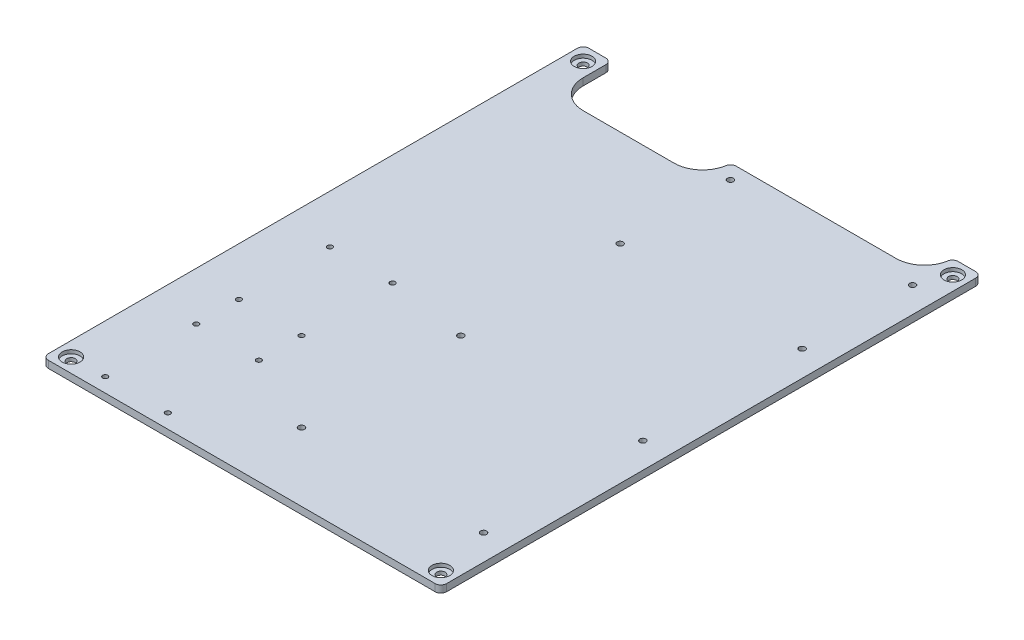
ISO-10303-21;
HEADER;
FILE_DESCRIPTION(('STEP AP214'),'2;1');
FILE_NAME('part.step','',(''),(''),'','','');
FILE_SCHEMA(('AUTOMOTIVE_DESIGN { 1 0 10303 214 1 1 1 1 }'));
ENDSEC;
DATA;
#1=APPLICATION_CONTEXT('core data for automotive mechanical design processes');
#2=APPLICATION_PROTOCOL_DEFINITION('international standard','automotive_design',2000,#1);
#3=PRODUCT_CONTEXT('',#1,'mechanical');
#4=PRODUCT('Part','Part','',(#3));
#5=PRODUCT_RELATED_PRODUCT_CATEGORY('part','',(#4));
#6=PRODUCT_DEFINITION_FORMATION('','',#4);
#7=PRODUCT_DEFINITION_CONTEXT('part definition',#1,'design');
#8=PRODUCT_DEFINITION('design','',#6,#7);
#9=PRODUCT_DEFINITION_SHAPE('','',#8);
#10=(LENGTH_UNIT() NAMED_UNIT(*) SI_UNIT(.MILLI.,.METRE.));
#11=(NAMED_UNIT(*) PLANE_ANGLE_UNIT() SI_UNIT($,.RADIAN.));
#12=(NAMED_UNIT(*) SI_UNIT($,.STERADIAN.) SOLID_ANGLE_UNIT());
#13=UNCERTAINTY_MEASURE_WITH_UNIT(LENGTH_MEASURE(1.E-05),#10,'distance_accuracy_value','');
#14=(GEOMETRIC_REPRESENTATION_CONTEXT(3) GLOBAL_UNCERTAINTY_ASSIGNED_CONTEXT((#13)) GLOBAL_UNIT_ASSIGNED_CONTEXT((#10,
#11,#12)) REPRESENTATION_CONTEXT('',''));
#15=CARTESIAN_POINT('',(0.,0.,0.));
#16=DIRECTION('',(0.,0.,1.));
#17=DIRECTION('',(1.,0.,0.));
#18=AXIS2_PLACEMENT_3D('',#15,#16,#17);
#19=CARTESIAN_POINT('',(0.,3.175,0.));
#20=DIRECTION('',(0.,-1.,0.));
#21=DIRECTION('',(0.,0.,-1.));
#22=AXIS2_PLACEMENT_3D('',#19,#20,#21);
#23=PLANE('',#22);
#24=CARTESIAN_POINT('',(21.59,3.175,-106.68));
#25=DIRECTION('',(0.,1.,0.));
#26=DIRECTION('',(0.,0.,1.));
#27=AXIS2_PLACEMENT_3D('',#24,#25,#26);
#28=CIRCLE('',#27,1.1303);
#29=CARTESIAN_POINT('',(21.59,3.175,-105.5497));
#30=VERTEX_POINT('',#29);
#31=EDGE_CURVE('E501',#30,#30,#28,.T.);
#32=ORIENTED_EDGE('',*,*,#31,.F.);
#33=EDGE_LOOP('',(#32));
#34=FACE_BOUND('',#33,.T.);
#35=CARTESIAN_POINT('',(49.53,3.175,-66.04));
#36=DIRECTION('',(0.,1.,0.));
#37=DIRECTION('',(0.,0.,1.));
#38=AXIS2_PLACEMENT_3D('',#35,#36,#37);
#39=CIRCLE('',#38,1.1303);
#40=CARTESIAN_POINT('',(49.53,3.175,-64.9097));
#41=VERTEX_POINT('',#40);
#42=EDGE_CURVE('E495',#41,#41,#39,.T.);
#43=ORIENTED_EDGE('',*,*,#42,.F.);
#44=EDGE_LOOP('',(#43));
#45=FACE_BOUND('',#44,.T.);
#46=CARTESIAN_POINT('',(21.59,3.175,-66.04));
#47=DIRECTION('',(0.,1.,0.));
#48=DIRECTION('',(0.,0.,1.));
#49=AXIS2_PLACEMENT_3D('',#46,#47,#48);
#50=CIRCLE('',#49,1.1303);
#51=CARTESIAN_POINT('',(21.59,3.175,-64.9097));
#52=VERTEX_POINT('',#51);
#53=EDGE_CURVE('E489',#52,#52,#50,.T.);
#54=ORIENTED_EDGE('',*,*,#53,.F.);
#55=EDGE_LOOP('',(#54));
#56=FACE_BOUND('',#55,.T.);
#57=CARTESIAN_POINT('',(49.53,3.175,-106.68));
#58=DIRECTION('',(0.,1.,0.));
#59=DIRECTION('',(0.,0.,1.));
#60=AXIS2_PLACEMENT_3D('',#57,#58,#59);
#61=CIRCLE('',#60,1.1303);
#62=CARTESIAN_POINT('',(49.53,3.175,-105.5497));
#63=VERTEX_POINT('',#62);
#64=EDGE_CURVE('E483',#63,#63,#61,.T.);
#65=ORIENTED_EDGE('',*,*,#64,.F.);
#66=EDGE_LOOP('',(#65));
#67=FACE_BOUND('',#66,.T.);
#68=CARTESIAN_POINT('',(21.59,3.175,-46.99));
#69=DIRECTION('',(0.,1.,0.));
#70=DIRECTION('',(0.,0.,1.));
#71=AXIS2_PLACEMENT_3D('',#68,#69,#70);
#72=CIRCLE('',#71,1.1303);
#73=CARTESIAN_POINT('',(21.59,3.175,-45.8597));
#74=VERTEX_POINT('',#73);
#75=EDGE_CURVE('E477',#74,#74,#72,.T.);
#76=ORIENTED_EDGE('',*,*,#75,.F.);
#77=EDGE_LOOP('',(#76));
#78=FACE_BOUND('',#77,.T.);
#79=CARTESIAN_POINT('',(21.59,3.175,-6.34999999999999));
#80=DIRECTION('',(0.,1.,0.));
#81=DIRECTION('',(0.,0.,1.));
#82=AXIS2_PLACEMENT_3D('',#79,#80,#81);
#83=CIRCLE('',#82,1.1303);
#84=CARTESIAN_POINT('',(21.59,3.175,-5.21969999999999));
#85=VERTEX_POINT('',#84);
#86=EDGE_CURVE('E465',#85,#85,#83,.T.);
#87=ORIENTED_EDGE('',*,*,#86,.F.);
#88=EDGE_LOOP('',(#87));
#89=FACE_BOUND('',#88,.T.);
#90=CARTESIAN_POINT('',(49.53,3.175,-46.99));
#91=DIRECTION('',(0.,1.,0.));
#92=DIRECTION('',(0.,0.,1.));
#93=AXIS2_PLACEMENT_3D('',#90,#91,#92);
#94=CIRCLE('',#93,1.1303);
#95=CARTESIAN_POINT('',(49.53,3.175,-45.8597));
#96=VERTEX_POINT('',#95);
#97=EDGE_CURVE('E459',#96,#96,#94,.T.);
#98=ORIENTED_EDGE('',*,*,#97,.F.);
#99=EDGE_LOOP('',(#98));
#100=FACE_BOUND('',#99,.T.);
#101=CARTESIAN_POINT('',(85.09,3.175,-221.996));
#102=DIRECTION('',(0.,1.,0.));
#103=DIRECTION('',(0.,0.,1.));
#104=AXIS2_PLACEMENT_3D('',#101,#102,#103);
#105=CIRCLE('',#104,1.35254999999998);
#106=CARTESIAN_POINT('',(85.09,3.175,-220.64345));
#107=VERTEX_POINT('',#106);
#108=EDGE_CURVE('E453',#107,#107,#105,.T.);
#109=ORIENTED_EDGE('',*,*,#108,.F.);
#110=EDGE_LOOP('',(#109));
#111=FACE_BOUND('',#110,.T.);
#112=CARTESIAN_POINT('',(166.37,3.175,-172.72));
#113=DIRECTION('',(0.,1.,0.));
#114=DIRECTION('',(0.,0.,1.));
#115=AXIS2_PLACEMENT_3D('',#112,#113,#114);
#116=CIRCLE('',#115,1.35254999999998);
#117=CARTESIAN_POINT('',(166.37,3.175,-171.36745));
#118=VERTEX_POINT('',#117);
#119=EDGE_CURVE('E447',#118,#118,#116,.T.);
#120=ORIENTED_EDGE('',*,*,#119,.F.);
#121=EDGE_LOOP('',(#120));
#122=FACE_BOUND('',#121,.T.);
#123=CARTESIAN_POINT('',(85.09,3.175,-172.72));
#124=DIRECTION('',(0.,1.,0.));
#125=DIRECTION('',(0.,0.,1.));
#126=AXIS2_PLACEMENT_3D('',#123,#124,#125);
#127=CIRCLE('',#126,1.35254999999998);
#128=CARTESIAN_POINT('',(85.09,3.175,-171.36745));
#129=VERTEX_POINT('',#128);
#130=EDGE_CURVE('E441',#129,#129,#127,.T.);
#131=ORIENTED_EDGE('',*,*,#130,.F.);
#132=EDGE_LOOP('',(#131));
#133=FACE_BOUND('',#132,.T.);
#134=CARTESIAN_POINT('',(166.37,3.175,-221.996));
#135=DIRECTION('',(0.,1.,0.));
#136=DIRECTION('',(0.,0.,1.));
#137=AXIS2_PLACEMENT_3D('',#134,#135,#136);
#138=CIRCLE('',#137,1.35254999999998);
#139=CARTESIAN_POINT('',(166.37,3.175,-220.64345));
#140=VERTEX_POINT('',#139);
#141=EDGE_CURVE('E435',#140,#140,#138,.T.);
#142=ORIENTED_EDGE('',*,*,#141,.F.);
#143=EDGE_LOOP('',(#142));
#144=FACE_BOUND('',#143,.T.);
#145=CARTESIAN_POINT('',(166.37,3.175,-101.6));
#146=DIRECTION('',(0.,1.,0.));
#147=DIRECTION('',(0.,0.,1.));
#148=AXIS2_PLACEMENT_3D('',#145,#146,#147);
#149=CIRCLE('',#148,1.35254999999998);
#150=CARTESIAN_POINT('',(166.37,3.175,-100.24745));
#151=VERTEX_POINT('',#150);
#152=EDGE_CURVE('E429',#151,#151,#149,.T.);
#153=ORIENTED_EDGE('',*,*,#152,.F.);
#154=EDGE_LOOP('',(#153));
#155=FACE_BOUND('',#154,.T.);
#156=CARTESIAN_POINT('',(85.09,3.175,-101.6));
#157=DIRECTION('',(0.,1.,0.));
#158=DIRECTION('',(0.,0.,1.));
#159=AXIS2_PLACEMENT_3D('',#156,#157,#158);
#160=CIRCLE('',#159,1.35254999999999);
#161=CARTESIAN_POINT('',(85.09,3.175,-100.24745));
#162=VERTEX_POINT('',#161);
#163=EDGE_CURVE('E423',#162,#162,#160,.T.);
#164=ORIENTED_EDGE('',*,*,#163,.F.);
#165=EDGE_LOOP('',(#164));
#166=FACE_BOUND('',#165,.T.);
#167=CARTESIAN_POINT('',(85.09,3.175,-30.48));
#168=DIRECTION('',(0.,1.,0.));
#169=DIRECTION('',(0.,0.,1.));
#170=AXIS2_PLACEMENT_3D('',#167,#168,#169);
#171=CIRCLE('',#170,1.35254999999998);
#172=CARTESIAN_POINT('',(85.09,3.175,-29.12745));
#173=VERTEX_POINT('',#172);
#174=EDGE_CURVE('E417',#173,#173,#171,.T.);
#175=ORIENTED_EDGE('',*,*,#174,.F.);
#176=EDGE_LOOP('',(#175));
#177=FACE_BOUND('',#176,.T.);
#178=CARTESIAN_POINT('',(166.37,3.175,-30.48));
#179=DIRECTION('',(0.,1.,0.));
#180=DIRECTION('',(0.,0.,1.));
#181=AXIS2_PLACEMENT_3D('',#178,#179,#180);
#182=CIRCLE('',#181,1.35254999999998);
#183=CARTESIAN_POINT('',(166.37,3.175,-29.12745));
#184=VERTEX_POINT('',#183);
#185=EDGE_CURVE('E411',#184,#184,#182,.T.);
#186=ORIENTED_EDGE('',*,*,#185,.F.);
#187=EDGE_LOOP('',(#186));
#188=FACE_BOUND('',#187,.T.);
#189=CARTESIAN_POINT('',(6.35000000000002,3.175,-6.34999999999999));
#190=DIRECTION('',(0.,1.,0.));
#191=DIRECTION('',(0.,0.,1.));
#192=AXIS2_PLACEMENT_3D('',#189,#190,#191);
#193=CIRCLE('',#192,3.96875);
#194=CARTESIAN_POINT('',(6.35000000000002,3.175,-2.38125));
#195=VERTEX_POINT('',#194);
#196=EDGE_CURVE('E405',#195,#195,#193,.T.);
#197=ORIENTED_EDGE('',*,*,#196,.F.);
#198=EDGE_LOOP('',(#197));
#199=FACE_BOUND('',#198,.T.);
#200=CARTESIAN_POINT('',(171.45,3.175,-6.34999999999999));
#201=DIRECTION('',(0.,1.,0.));
#202=DIRECTION('',(0.,0.,1.));
#203=AXIS2_PLACEMENT_3D('',#200,#201,#202);
#204=CIRCLE('',#203,3.96874999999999);
#205=CARTESIAN_POINT('',(171.45,3.175,-2.38125));
#206=VERTEX_POINT('',#205);
#207=EDGE_CURVE('E393',#206,#206,#204,.T.);
#208=ORIENTED_EDGE('',*,*,#207,.F.);
#209=EDGE_LOOP('',(#208));
#210=FACE_BOUND('',#209,.T.);
#211=CARTESIAN_POINT('',(171.45,3.175,-234.95));
#212=DIRECTION('',(0.,1.,0.));
#213=DIRECTION('',(0.,0.,1.));
#214=AXIS2_PLACEMENT_3D('',#211,#212,#213);
#215=CIRCLE('',#214,3.96874999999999);
#216=CARTESIAN_POINT('',(171.45,3.175,-230.98125));
#217=VERTEX_POINT('',#216);
#218=EDGE_CURVE('E381',#217,#217,#215,.T.);
#219=ORIENTED_EDGE('',*,*,#218,.F.);
#220=EDGE_LOOP('',(#219));
#221=FACE_BOUND('',#220,.T.);
#222=CARTESIAN_POINT('',(6.35000000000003,3.175,-234.95));
#223=DIRECTION('',(0.,1.,0.));
#224=DIRECTION('',(0.,0.,1.));
#225=AXIS2_PLACEMENT_3D('',#222,#223,#224);
#226=CIRCLE('',#225,3.96875);
#227=CARTESIAN_POINT('',(6.35000000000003,3.175,-230.98125));
#228=VERTEX_POINT('',#227);
#229=EDGE_CURVE('E369',#228,#228,#226,.T.);
#230=ORIENTED_EDGE('',*,*,#229,.F.);
#231=EDGE_LOOP('',(#230));
#232=FACE_BOUND('',#231,.T.);
#233=DIRECTION('',(-1.,0.,0.));
#234=VECTOR('',#233,1.);
#235=CARTESIAN_POINT('',(0.,3.175,-241.3));
#236=LINE('',#235,#234);
#237=CARTESIAN_POINT('',(175.26,3.175,-241.3));
#238=VERTEX_POINT('',#237);
#239=CARTESIAN_POINT('',(167.426842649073,3.175,-241.3));
#240=VERTEX_POINT('',#239);
#241=EDGE_CURVE('E208',#238,#240,#236,.T.);
#242=ORIENTED_EDGE('',*,*,#241,.T.);
#243=CARTESIAN_POINT('',(167.426842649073,3.175,-238.76));
#244=DIRECTION('',(0.,-1.,0.));
#245=DIRECTION('',(0.,0.,-1.));
#246=AXIS2_PLACEMENT_3D('',#243,#244,#245);
#247=CIRCLE('',#246,2.54);
#248=CARTESIAN_POINT('',(164.922368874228,3.175,-239.183333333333));
#249=VERTEX_POINT('',#248);
#250=EDGE_CURVE('E281',#240,#249,#247,.F.);
#251=ORIENTED_EDGE('',*,*,#250,.T.);
#252=CARTESIAN_POINT('',(152.4,3.175,-241.3));
#253=DIRECTION('',(0.,-1.,0.));
#254=DIRECTION('',(0.,0.,-1.));
#255=AXIS2_PLACEMENT_3D('',#252,#253,#254);
#256=CIRCLE('',#255,12.7);
#257=CARTESIAN_POINT('',(152.4,3.175,-228.6));
#258=VERTEX_POINT('',#257);
#259=EDGE_CURVE('E259',#249,#258,#256,.T.);
#260=ORIENTED_EDGE('',*,*,#259,.T.);
#261=DIRECTION('',(1.,0.,0.));
#262=VECTOR('',#261,1.);
#263=CARTESIAN_POINT('',(165.1,3.175,-228.6));
#264=LINE('',#263,#262);
#265=CARTESIAN_POINT('',(81.066842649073,3.175,-228.6));
#266=VERTEX_POINT('',#265);
#267=EDGE_CURVE('E310',#266,#258,#264,.T.);
#268=ORIENTED_EDGE('',*,*,#267,.F.);
#269=CARTESIAN_POINT('',(81.066842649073,3.175,-226.06));
#270=DIRECTION('',(0.,-1.,0.));
#271=DIRECTION('',(0.,0.,-1.));
#272=AXIS2_PLACEMENT_3D('',#269,#270,#271);
#273=CIRCLE('',#272,2.54);
#274=CARTESIAN_POINT('',(78.5623688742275,3.175,-226.483333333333));
#275=VERTEX_POINT('',#274);
#276=EDGE_CURVE('E58',#266,#275,#273,.F.);
#277=ORIENTED_EDGE('',*,*,#276,.T.);
#278=CARTESIAN_POINT('',(66.04,3.175,-228.6));
#279=DIRECTION('',(0.,-1.,0.));
#280=DIRECTION('',(0.,0.,-1.));
#281=AXIS2_PLACEMENT_3D('',#278,#279,#280);
#282=CIRCLE('',#281,12.7);
#283=CARTESIAN_POINT('',(66.04,3.175,-215.9));
#284=VERTEX_POINT('',#283);
#285=EDGE_CURVE('E265',#275,#284,#282,.T.);
#286=ORIENTED_EDGE('',*,*,#285,.T.);
#287=DIRECTION('',(1.,0.,0.));
#288=VECTOR('',#287,1.);
#289=CARTESIAN_POINT('',(12.7,3.175,-215.9));
#290=LINE('',#289,#288);
#291=CARTESIAN_POINT('',(25.4,3.175,-215.9));
#292=VERTEX_POINT('',#291);
#293=EDGE_CURVE('E303',#292,#284,#290,.T.);
#294=ORIENTED_EDGE('',*,*,#293,.F.);
#295=CARTESIAN_POINT('',(25.4,3.175,-228.6));
#296=DIRECTION('',(0.,-1.,0.));
#297=DIRECTION('',(0.,0.,-1.));
#298=AXIS2_PLACEMENT_3D('',#295,#296,#297);
#299=CIRCLE('',#298,12.7);
#300=CARTESIAN_POINT('',(12.7,3.175,-228.6));
#301=VERTEX_POINT('',#300);
#302=EDGE_CURVE('E269',#292,#301,#299,.T.);
#303=ORIENTED_EDGE('',*,*,#302,.T.);
#304=DIRECTION('',(0.,0.,1.));
#305=VECTOR('',#304,1.);
#306=CARTESIAN_POINT('',(12.7,3.175,-241.3));
#307=LINE('',#306,#305);
#308=CARTESIAN_POINT('',(12.7,3.175,-238.76));
#309=VERTEX_POINT('',#308);
#310=EDGE_CURVE('E302',#309,#301,#307,.T.);
#311=ORIENTED_EDGE('',*,*,#310,.F.);
#312=CARTESIAN_POINT('',(10.16,3.175,-238.76));
#313=DIRECTION('',(0.,-1.,0.));
#314=DIRECTION('',(0.,0.,-1.));
#315=AXIS2_PLACEMENT_3D('',#312,#313,#314);
#316=CIRCLE('',#315,2.54);
#317=CARTESIAN_POINT('',(10.16,3.175,-241.3));
#318=VERTEX_POINT('',#317);
#319=EDGE_CURVE('E226',#309,#318,#316,.F.);
#320=ORIENTED_EDGE('',*,*,#319,.T.);
#321=CARTESIAN_POINT('',(2.54,3.175,-241.3));
#322=VERTEX_POINT('',#321);
#323=EDGE_CURVE('E186',#318,#322,#236,.T.);
#324=ORIENTED_EDGE('',*,*,#323,.T.);
#325=CARTESIAN_POINT('',(2.54,3.175,-238.76));
#326=DIRECTION('',(0.,-1.,0.));
#327=DIRECTION('',(0.,0.,-1.));
#328=AXIS2_PLACEMENT_3D('',#325,#326,#327);
#329=CIRCLE('',#328,2.54);
#330=CARTESIAN_POINT('',(0.,3.175,-238.76));
#331=VERTEX_POINT('',#330);
#332=EDGE_CURVE('E218',#322,#331,#329,.F.);
#333=ORIENTED_EDGE('',*,*,#332,.T.);
#334=DIRECTION('',(0.,0.,1.));
#335=VECTOR('',#334,1.);
#336=CARTESIAN_POINT('',(0.,3.175,0.));
#337=LINE('',#336,#335);
#338=CARTESIAN_POINT('',(0.,3.175,-2.54));
#339=VERTEX_POINT('',#338);
#340=EDGE_CURVE('E198',#331,#339,#337,.T.);
#341=ORIENTED_EDGE('',*,*,#340,.T.);
#342=CARTESIAN_POINT('',(2.54,3.175,-2.54));
#343=DIRECTION('',(0.,-1.,0.));
#344=DIRECTION('',(0.,0.,-1.));
#345=AXIS2_PLACEMENT_3D('',#342,#343,#344);
#346=CIRCLE('',#345,2.54);
#347=CARTESIAN_POINT('',(2.54,3.175,0.));
#348=VERTEX_POINT('',#347);
#349=EDGE_CURVE('E222',#339,#348,#346,.F.);
#350=ORIENTED_EDGE('',*,*,#349,.T.);
#351=DIRECTION('',(1.,0.,0.));
#352=VECTOR('',#351,1.);
#353=CARTESIAN_POINT('',(0.,3.175,0.));
#354=LINE('',#353,#352);
#355=CARTESIAN_POINT('',(175.26,3.175,0.));
#356=VERTEX_POINT('',#355);
#357=EDGE_CURVE('E316',#348,#356,#354,.T.);
#358=ORIENTED_EDGE('',*,*,#357,.T.);
#359=CARTESIAN_POINT('',(175.26,3.175,-2.54));
#360=DIRECTION('',(0.,-1.,0.));
#361=DIRECTION('',(0.,0.,-1.));
#362=AXIS2_PLACEMENT_3D('',#359,#360,#361);
#363=CIRCLE('',#362,2.54);
#364=CARTESIAN_POINT('',(177.8,3.175,-2.54));
#365=VERTEX_POINT('',#364);
#366=EDGE_CURVE('E224',#356,#365,#363,.F.);
#367=ORIENTED_EDGE('',*,*,#366,.T.);
#368=DIRECTION('',(0.,0.,-1.));
#369=VECTOR('',#368,1.);
#370=CARTESIAN_POINT('',(177.8,3.175,0.));
#371=LINE('',#370,#369);
#372=CARTESIAN_POINT('',(177.8,3.175,-238.76));
#373=VERTEX_POINT('',#372);
#374=EDGE_CURVE('E319',#365,#373,#371,.T.);
#375=ORIENTED_EDGE('',*,*,#374,.T.);
#376=CARTESIAN_POINT('',(175.26,3.175,-238.76));
#377=DIRECTION('',(0.,-1.,0.));
#378=DIRECTION('',(0.,0.,-1.));
#379=AXIS2_PLACEMENT_3D('',#376,#377,#378);
#380=CIRCLE('',#379,2.54);
#381=EDGE_CURVE('E220',#373,#238,#380,.F.);
#382=ORIENTED_EDGE('',*,*,#381,.T.);
#383=EDGE_LOOP('',(#242,#251,#260,#268,#277,#286,#294,#303,#311,#320,#324,#333,#341,#350,#358,
#367,#375,#382));
#384=FACE_BOUND('',#383,.T.);
#385=CARTESIAN_POINT('',(49.53,3.175,-6.34999999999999));
#386=DIRECTION('',(0.,1.,0.));
#387=DIRECTION('',(0.,0.,1.));
#388=AXIS2_PLACEMENT_3D('',#385,#386,#387);
#389=CIRCLE('',#388,1.1303);
#390=CARTESIAN_POINT('',(49.53,3.175,-5.21969999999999));
#391=VERTEX_POINT('',#390);
#392=EDGE_CURVE('E471',#391,#391,#389,.T.);
#393=ORIENTED_EDGE('',*,*,#392,.F.);
#394=EDGE_LOOP('',(#393));
#395=FACE_BOUND('',#394,.T.);
#396=ADVANCED_FACE('F43',(#34,#45,#56,#67,#78,#89,#100,#111,#122,#133,#144,#155,#166,#177,#188,
#199,#210,#221,#232,#384,#395),#23,.F.);
#397=CARTESIAN_POINT('',(0.,0.,0.));
#398=DIRECTION('',(0.,-1.,0.));
#399=DIRECTION('',(0.,0.,-1.));
#400=AXIS2_PLACEMENT_3D('',#397,#398,#399);
#401=PLANE('',#400);
#402=CARTESIAN_POINT('',(21.59,0.,-106.68));
#403=DIRECTION('',(0.,1.,0.));
#404=DIRECTION('',(0.,0.,1.));
#405=AXIS2_PLACEMENT_3D('',#402,#403,#404);
#406=CIRCLE('',#405,1.1303);
#407=CARTESIAN_POINT('',(21.59,0.,-105.5497));
#408=VERTEX_POINT('',#407);
#409=EDGE_CURVE('E498',#408,#408,#406,.T.);
#410=ORIENTED_EDGE('',*,*,#409,.T.);
#411=EDGE_LOOP('',(#410));
#412=FACE_BOUND('',#411,.T.);
#413=CARTESIAN_POINT('',(49.53,0.,-66.04));
#414=DIRECTION('',(0.,1.,0.));
#415=DIRECTION('',(0.,0.,1.));
#416=AXIS2_PLACEMENT_3D('',#413,#414,#415);
#417=CIRCLE('',#416,1.1303);
#418=CARTESIAN_POINT('',(49.53,0.,-64.9097));
#419=VERTEX_POINT('',#418);
#420=EDGE_CURVE('E492',#419,#419,#417,.T.);
#421=ORIENTED_EDGE('',*,*,#420,.T.);
#422=EDGE_LOOP('',(#421));
#423=FACE_BOUND('',#422,.T.);
#424=CARTESIAN_POINT('',(21.59,0.,-66.04));
#425=DIRECTION('',(0.,1.,0.));
#426=DIRECTION('',(0.,0.,1.));
#427=AXIS2_PLACEMENT_3D('',#424,#425,#426);
#428=CIRCLE('',#427,1.1303);
#429=CARTESIAN_POINT('',(21.59,0.,-64.9097));
#430=VERTEX_POINT('',#429);
#431=EDGE_CURVE('E486',#430,#430,#428,.T.);
#432=ORIENTED_EDGE('',*,*,#431,.T.);
#433=EDGE_LOOP('',(#432));
#434=FACE_BOUND('',#433,.T.);
#435=CARTESIAN_POINT('',(49.53,0.,-106.68));
#436=DIRECTION('',(0.,1.,0.));
#437=DIRECTION('',(0.,0.,1.));
#438=AXIS2_PLACEMENT_3D('',#435,#436,#437);
#439=CIRCLE('',#438,1.1303);
#440=CARTESIAN_POINT('',(49.53,0.,-105.5497));
#441=VERTEX_POINT('',#440);
#442=EDGE_CURVE('E480',#441,#441,#439,.T.);
#443=ORIENTED_EDGE('',*,*,#442,.T.);
#444=EDGE_LOOP('',(#443));
#445=FACE_BOUND('',#444,.T.);
#446=CARTESIAN_POINT('',(21.59,0.,-46.99));
#447=DIRECTION('',(0.,1.,0.));
#448=DIRECTION('',(0.,0.,1.));
#449=AXIS2_PLACEMENT_3D('',#446,#447,#448);
#450=CIRCLE('',#449,1.1303);
#451=CARTESIAN_POINT('',(21.59,0.,-45.8597));
#452=VERTEX_POINT('',#451);
#453=EDGE_CURVE('E474',#452,#452,#450,.T.);
#454=ORIENTED_EDGE('',*,*,#453,.T.);
#455=EDGE_LOOP('',(#454));
#456=FACE_BOUND('',#455,.T.);
#457=CARTESIAN_POINT('',(49.53,0.,-6.34999999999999));
#458=DIRECTION('',(0.,1.,0.));
#459=DIRECTION('',(0.,0.,1.));
#460=AXIS2_PLACEMENT_3D('',#457,#458,#459);
#461=CIRCLE('',#460,1.1303);
#462=CARTESIAN_POINT('',(49.53,0.,-5.21969999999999));
#463=VERTEX_POINT('',#462);
#464=EDGE_CURVE('E468',#463,#463,#461,.T.);
#465=ORIENTED_EDGE('',*,*,#464,.T.);
#466=EDGE_LOOP('',(#465));
#467=FACE_BOUND('',#466,.T.);
#468=CARTESIAN_POINT('',(21.59,0.,-6.34999999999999));
#469=DIRECTION('',(0.,1.,0.));
#470=DIRECTION('',(0.,0.,1.));
#471=AXIS2_PLACEMENT_3D('',#468,#469,#470);
#472=CIRCLE('',#471,1.1303);
#473=CARTESIAN_POINT('',(21.59,0.,-5.21969999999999));
#474=VERTEX_POINT('',#473);
#475=EDGE_CURVE('E462',#474,#474,#472,.T.);
#476=ORIENTED_EDGE('',*,*,#475,.T.);
#477=EDGE_LOOP('',(#476));
#478=FACE_BOUND('',#477,.T.);
#479=CARTESIAN_POINT('',(49.53,0.,-46.99));
#480=DIRECTION('',(0.,1.,0.));
#481=DIRECTION('',(0.,0.,1.));
#482=AXIS2_PLACEMENT_3D('',#479,#480,#481);
#483=CIRCLE('',#482,1.1303);
#484=CARTESIAN_POINT('',(49.53,0.,-45.8597));
#485=VERTEX_POINT('',#484);
#486=EDGE_CURVE('E456',#485,#485,#483,.T.);
#487=ORIENTED_EDGE('',*,*,#486,.T.);
#488=EDGE_LOOP('',(#487));
#489=FACE_BOUND('',#488,.T.);
#490=CARTESIAN_POINT('',(85.09,0.,-221.996));
#491=DIRECTION('',(0.,1.,0.));
#492=DIRECTION('',(0.,0.,1.));
#493=AXIS2_PLACEMENT_3D('',#490,#491,#492);
#494=CIRCLE('',#493,1.35254999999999);
#495=CARTESIAN_POINT('',(85.09,0.,-220.64345));
#496=VERTEX_POINT('',#495);
#497=EDGE_CURVE('E450',#496,#496,#494,.T.);
#498=ORIENTED_EDGE('',*,*,#497,.T.);
#499=EDGE_LOOP('',(#498));
#500=FACE_BOUND('',#499,.T.);
#501=CARTESIAN_POINT('',(166.37,0.,-172.72));
#502=DIRECTION('',(0.,1.,0.));
#503=DIRECTION('',(0.,0.,1.));
#504=AXIS2_PLACEMENT_3D('',#501,#502,#503);
#505=CIRCLE('',#504,1.35255000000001);
#506=CARTESIAN_POINT('',(166.37,0.,-171.36745));
#507=VERTEX_POINT('',#506);
#508=EDGE_CURVE('E444',#507,#507,#505,.T.);
#509=ORIENTED_EDGE('',*,*,#508,.T.);
#510=EDGE_LOOP('',(#509));
#511=FACE_BOUND('',#510,.T.);
#512=CARTESIAN_POINT('',(85.09,0.,-172.72));
#513=DIRECTION('',(0.,1.,0.));
#514=DIRECTION('',(0.,0.,1.));
#515=AXIS2_PLACEMENT_3D('',#512,#513,#514);
#516=CIRCLE('',#515,1.35254999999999);
#517=CARTESIAN_POINT('',(85.09,0.,-171.36745));
#518=VERTEX_POINT('',#517);
#519=EDGE_CURVE('E438',#518,#518,#516,.T.);
#520=ORIENTED_EDGE('',*,*,#519,.T.);
#521=EDGE_LOOP('',(#520));
#522=FACE_BOUND('',#521,.T.);
#523=CARTESIAN_POINT('',(166.37,0.,-221.996));
#524=DIRECTION('',(0.,1.,0.));
#525=DIRECTION('',(0.,0.,1.));
#526=AXIS2_PLACEMENT_3D('',#523,#524,#525);
#527=CIRCLE('',#526,1.35255000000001);
#528=CARTESIAN_POINT('',(166.37,0.,-220.64345));
#529=VERTEX_POINT('',#528);
#530=EDGE_CURVE('E432',#529,#529,#527,.T.);
#531=ORIENTED_EDGE('',*,*,#530,.T.);
#532=EDGE_LOOP('',(#531));
#533=FACE_BOUND('',#532,.T.);
#534=CARTESIAN_POINT('',(166.37,0.,-101.6));
#535=DIRECTION('',(0.,1.,0.));
#536=DIRECTION('',(0.,0.,1.));
#537=AXIS2_PLACEMENT_3D('',#534,#535,#536);
#538=CIRCLE('',#537,1.35255000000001);
#539=CARTESIAN_POINT('',(166.37,0.,-100.24745));
#540=VERTEX_POINT('',#539);
#541=EDGE_CURVE('E426',#540,#540,#538,.T.);
#542=ORIENTED_EDGE('',*,*,#541,.T.);
#543=EDGE_LOOP('',(#542));
#544=FACE_BOUND('',#543,.T.);
#545=CARTESIAN_POINT('',(85.09,0.,-101.6));
#546=DIRECTION('',(0.,1.,0.));
#547=DIRECTION('',(0.,0.,1.));
#548=AXIS2_PLACEMENT_3D('',#545,#546,#547);
#549=CIRCLE('',#548,1.35254999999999);
#550=CARTESIAN_POINT('',(85.09,0.,-100.24745));
#551=VERTEX_POINT('',#550);
#552=EDGE_CURVE('E420',#551,#551,#549,.T.);
#553=ORIENTED_EDGE('',*,*,#552,.T.);
#554=EDGE_LOOP('',(#553));
#555=FACE_BOUND('',#554,.T.);
#556=CARTESIAN_POINT('',(166.37,0.,-30.48));
#557=DIRECTION('',(0.,1.,0.));
#558=DIRECTION('',(0.,0.,1.));
#559=AXIS2_PLACEMENT_3D('',#556,#557,#558);
#560=CIRCLE('',#559,1.35255000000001);
#561=CARTESIAN_POINT('',(166.37,0.,-29.12745));
#562=VERTEX_POINT('',#561);
#563=EDGE_CURVE('E408',#562,#562,#560,.T.);
#564=ORIENTED_EDGE('',*,*,#563,.T.);
#565=EDGE_LOOP('',(#564));
#566=FACE_BOUND('',#565,.T.);
#567=CARTESIAN_POINT('',(6.35000000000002,0.,-6.34999999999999));
#568=DIRECTION('',(0.,1.,0.));
#569=DIRECTION('',(0.,0.,1.));
#570=AXIS2_PLACEMENT_3D('',#567,#568,#569);
#571=CIRCLE('',#570,1.89865000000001);
#572=CARTESIAN_POINT('',(6.35000000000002,0.,-4.45134999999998));
#573=VERTEX_POINT('',#572);
#574=EDGE_CURVE('E396',#573,#573,#571,.T.);
#575=ORIENTED_EDGE('',*,*,#574,.T.);
#576=EDGE_LOOP('',(#575));
#577=FACE_BOUND('',#576,.T.);
#578=CARTESIAN_POINT('',(171.45,0.,-6.34999999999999));
#579=DIRECTION('',(0.,1.,0.));
#580=DIRECTION('',(0.,0.,1.));
#581=AXIS2_PLACEMENT_3D('',#578,#579,#580);
#582=CIRCLE('',#581,1.89865);
#583=CARTESIAN_POINT('',(171.45,0.,-4.45134999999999));
#584=VERTEX_POINT('',#583);
#585=EDGE_CURVE('E384',#584,#584,#582,.T.);
#586=ORIENTED_EDGE('',*,*,#585,.T.);
#587=EDGE_LOOP('',(#586));
#588=FACE_BOUND('',#587,.T.);
#589=CARTESIAN_POINT('',(171.45,0.,-234.95));
#590=DIRECTION('',(0.,1.,0.));
#591=DIRECTION('',(0.,0.,1.));
#592=AXIS2_PLACEMENT_3D('',#589,#590,#591);
#593=CIRCLE('',#592,1.89865);
#594=CARTESIAN_POINT('',(171.45,0.,-233.05135));
#595=VERTEX_POINT('',#594);
#596=EDGE_CURVE('E372',#595,#595,#593,.T.);
#597=ORIENTED_EDGE('',*,*,#596,.T.);
#598=EDGE_LOOP('',(#597));
#599=FACE_BOUND('',#598,.T.);
#600=CARTESIAN_POINT('',(6.35000000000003,0.,-234.95));
#601=DIRECTION('',(0.,1.,0.));
#602=DIRECTION('',(0.,0.,1.));
#603=AXIS2_PLACEMENT_3D('',#600,#601,#602);
#604=CIRCLE('',#603,1.89865000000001);
#605=CARTESIAN_POINT('',(6.35000000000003,0.,-233.05135));
#606=VERTEX_POINT('',#605);
#607=EDGE_CURVE('E359',#606,#606,#604,.T.);
#608=ORIENTED_EDGE('',*,*,#607,.T.);
#609=EDGE_LOOP('',(#608));
#610=FACE_BOUND('',#609,.T.);
#611=CARTESIAN_POINT('',(152.4,0.,-241.3));
#612=DIRECTION('',(0.,-1.,0.));
#613=DIRECTION('',(0.,0.,-1.));
#614=AXIS2_PLACEMENT_3D('',#611,#612,#613);
#615=CIRCLE('',#614,12.7);
#616=CARTESIAN_POINT('',(152.4,0.,-228.6));
#617=VERTEX_POINT('',#616);
#618=CARTESIAN_POINT('',(164.922368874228,0.,-239.183333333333));
#619=VERTEX_POINT('',#618);
#620=EDGE_CURVE('E257',#617,#619,#615,.F.);
#621=ORIENTED_EDGE('',*,*,#620,.T.);
#622=CARTESIAN_POINT('',(167.426842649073,0.,-238.76));
#623=DIRECTION('',(0.,-1.,0.));
#624=DIRECTION('',(0.,0.,-1.));
#625=AXIS2_PLACEMENT_3D('',#622,#623,#624);
#626=CIRCLE('',#625,2.54);
#627=CARTESIAN_POINT('',(167.426842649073,0.,-241.3));
#628=VERTEX_POINT('',#627);
#629=EDGE_CURVE('E276',#619,#628,#626,.T.);
#630=ORIENTED_EDGE('',*,*,#629,.T.);
#631=DIRECTION('',(-1.,0.,0.));
#632=VECTOR('',#631,1.);
#633=CARTESIAN_POINT('',(0.,0.,-241.3));
#634=LINE('',#633,#632);
#635=CARTESIAN_POINT('',(175.26,0.,-241.3));
#636=VERTEX_POINT('',#635);
#637=EDGE_CURVE('E194',#636,#628,#634,.T.);
#638=ORIENTED_EDGE('',*,*,#637,.F.);
#639=CARTESIAN_POINT('',(175.26,0.,-238.76));
#640=DIRECTION('',(0.,-1.,0.));
#641=DIRECTION('',(0.,0.,-1.));
#642=AXIS2_PLACEMENT_3D('',#639,#640,#641);
#643=CIRCLE('',#642,2.54);
#644=CARTESIAN_POINT('',(177.8,0.,-238.76));
#645=VERTEX_POINT('',#644);
#646=EDGE_CURVE('E212',#636,#645,#643,.T.);
#647=ORIENTED_EDGE('',*,*,#646,.T.);
#648=DIRECTION('',(0.,0.,-1.));
#649=VECTOR('',#648,1.);
#650=CARTESIAN_POINT('',(177.8,0.,0.));
#651=LINE('',#650,#649);
#652=CARTESIAN_POINT('',(177.8,0.,-2.54));
#653=VERTEX_POINT('',#652);
#654=EDGE_CURVE('E195',#653,#645,#651,.T.);
#655=ORIENTED_EDGE('',*,*,#654,.F.);
#656=CARTESIAN_POINT('',(175.26,0.,-2.54));
#657=DIRECTION('',(0.,-1.,0.));
#658=DIRECTION('',(0.,0.,-1.));
#659=AXIS2_PLACEMENT_3D('',#656,#657,#658);
#660=CIRCLE('',#659,2.54);
#661=CARTESIAN_POINT('',(175.26,0.,0.));
#662=VERTEX_POINT('',#661);
#663=EDGE_CURVE('E177',#653,#662,#660,.T.);
#664=ORIENTED_EDGE('',*,*,#663,.T.);
#665=DIRECTION('',(1.,0.,0.));
#666=VECTOR('',#665,1.);
#667=CARTESIAN_POINT('',(0.,0.,0.));
#668=LINE('',#667,#666);
#669=CARTESIAN_POINT('',(2.54,0.,0.));
#670=VERTEX_POINT('',#669);
#671=EDGE_CURVE('E200',#670,#662,#668,.T.);
#672=ORIENTED_EDGE('',*,*,#671,.F.);
#673=CARTESIAN_POINT('',(2.54,0.,-2.54));
#674=DIRECTION('',(0.,-1.,0.));
#675=DIRECTION('',(0.,0.,-1.));
#676=AXIS2_PLACEMENT_3D('',#673,#674,#675);
#677=CIRCLE('',#676,2.54);
#678=CARTESIAN_POINT('',(0.,0.,-2.54));
#679=VERTEX_POINT('',#678);
#680=EDGE_CURVE('E214',#670,#679,#677,.T.);
#681=ORIENTED_EDGE('',*,*,#680,.T.);
#682=DIRECTION('',(0.,0.,1.));
#683=VECTOR('',#682,1.);
#684=CARTESIAN_POINT('',(0.,0.,0.));
#685=LINE('',#684,#683);
#686=CARTESIAN_POINT('',(0.,0.,-238.76));
#687=VERTEX_POINT('',#686);
#688=EDGE_CURVE('E308',#687,#679,#685,.T.);
#689=ORIENTED_EDGE('',*,*,#688,.F.);
#690=CARTESIAN_POINT('',(2.54,0.,-238.76));
#691=DIRECTION('',(0.,-1.,0.));
#692=DIRECTION('',(0.,0.,-1.));
#693=AXIS2_PLACEMENT_3D('',#690,#691,#692);
#694=CIRCLE('',#693,2.54);
#695=CARTESIAN_POINT('',(2.54,0.,-241.3));
#696=VERTEX_POINT('',#695);
#697=EDGE_CURVE('E187',#687,#696,#694,.T.);
#698=ORIENTED_EDGE('',*,*,#697,.T.);
#699=CARTESIAN_POINT('',(10.16,0.,-241.3));
#700=VERTEX_POINT('',#699);
#701=EDGE_CURVE('E183',#700,#696,#634,.T.);
#702=ORIENTED_EDGE('',*,*,#701,.F.);
#703=CARTESIAN_POINT('',(10.16,0.,-238.76));
#704=DIRECTION('',(0.,-1.,0.));
#705=DIRECTION('',(0.,0.,-1.));
#706=AXIS2_PLACEMENT_3D('',#703,#704,#705);
#707=CIRCLE('',#706,2.54);
#708=CARTESIAN_POINT('',(12.7,0.,-238.76));
#709=VERTEX_POINT('',#708);
#710=EDGE_CURVE('E167',#700,#709,#707,.T.);
#711=ORIENTED_EDGE('',*,*,#710,.T.);
#712=DIRECTION('',(0.,0.,1.));
#713=VECTOR('',#712,1.);
#714=CARTESIAN_POINT('',(12.7000000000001,0.,0.));
#715=LINE('',#714,#713);
#716=CARTESIAN_POINT('',(12.7,0.,-228.6));
#717=VERTEX_POINT('',#716);
#718=EDGE_CURVE('E207',#709,#717,#715,.T.);
#719=ORIENTED_EDGE('',*,*,#718,.T.);
#720=CARTESIAN_POINT('',(25.4,0.,-228.6));
#721=DIRECTION('',(0.,-1.,0.));
#722=DIRECTION('',(0.,0.,-1.));
#723=AXIS2_PLACEMENT_3D('',#720,#721,#722);
#724=CIRCLE('',#723,12.7);
#725=CARTESIAN_POINT('',(25.4,0.,-215.9));
#726=VERTEX_POINT('',#725);
#727=EDGE_CURVE('E267',#717,#726,#724,.F.);
#728=ORIENTED_EDGE('',*,*,#727,.T.);
#729=DIRECTION('',(1.,0.,0.));
#730=VECTOR('',#729,1.);
#731=CARTESIAN_POINT('',(0.,0.,-215.9));
#732=LINE('',#731,#730);
#733=CARTESIAN_POINT('',(66.04,0.,-215.9));
#734=VERTEX_POINT('',#733);
#735=EDGE_CURVE('E204',#726,#734,#732,.T.);
#736=ORIENTED_EDGE('',*,*,#735,.T.);
#737=CARTESIAN_POINT('',(66.04,0.,-228.6));
#738=DIRECTION('',(0.,-1.,0.));
#739=DIRECTION('',(0.,0.,-1.));
#740=AXIS2_PLACEMENT_3D('',#737,#738,#739);
#741=CIRCLE('',#740,12.7);
#742=CARTESIAN_POINT('',(78.5623688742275,0.,-226.483333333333));
#743=VERTEX_POINT('',#742);
#744=EDGE_CURVE('E262',#734,#743,#741,.F.);
#745=ORIENTED_EDGE('',*,*,#744,.T.);
#746=CARTESIAN_POINT('',(81.066842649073,0.,-226.06));
#747=DIRECTION('',(0.,-1.,0.));
#748=DIRECTION('',(0.,0.,-1.));
#749=AXIS2_PLACEMENT_3D('',#746,#747,#748);
#750=CIRCLE('',#749,2.54);
#751=CARTESIAN_POINT('',(81.066842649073,0.,-228.6));
#752=VERTEX_POINT('',#751);
#753=EDGE_CURVE('E274',#743,#752,#750,.T.);
#754=ORIENTED_EDGE('',*,*,#753,.T.);
#755=DIRECTION('',(1.,0.,0.));
#756=VECTOR('',#755,1.);
#757=CARTESIAN_POINT('',(0.,0.,-228.6));
#758=LINE('',#757,#756);
#759=EDGE_CURVE('E306',#752,#617,#758,.T.);
#760=ORIENTED_EDGE('',*,*,#759,.T.);
#761=EDGE_LOOP('',(#621,#630,#638,#647,#655,#664,#672,#681,#689,#698,#702,#711,#719,#728,#736,
#745,#754,#760));
#762=FACE_BOUND('',#761,.T.);
#763=CARTESIAN_POINT('',(85.09,0.,-30.48));
#764=DIRECTION('',(0.,1.,0.));
#765=DIRECTION('',(0.,0.,1.));
#766=AXIS2_PLACEMENT_3D('',#763,#764,#765);
#767=CIRCLE('',#766,1.35254999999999);
#768=CARTESIAN_POINT('',(85.09,0.,-29.12745));
#769=VERTEX_POINT('',#768);
#770=EDGE_CURVE('E414',#769,#769,#767,.T.);
#771=ORIENTED_EDGE('',*,*,#770,.T.);
#772=EDGE_LOOP('',(#771));
#773=FACE_BOUND('',#772,.T.);
#774=ADVANCED_FACE('F191',(#412,#423,#434,#445,#456,#467,#478,#489,#500,#511,#522,#533,#544,
#555,#566,#577,#588,#599,#610,#762,#773),#401,.T.);
#775=CARTESIAN_POINT('',(0.,3.175,-241.3));
#776=DIRECTION('',(0.,0.,1.));
#777=DIRECTION('',(1.,0.,0.));
#778=AXIS2_PLACEMENT_3D('',#775,#776,#777);
#779=PLANE('',#778);
#780=ORIENTED_EDGE('',*,*,#637,.T.);
#781=DIRECTION('',(0.,1.,0.));
#782=VECTOR('',#781,1.);
#783=CARTESIAN_POINT('',(167.426842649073,3.175,-241.3));
#784=LINE('',#783,#782);
#785=EDGE_CURVE('E278',#628,#240,#784,.T.);
#786=ORIENTED_EDGE('',*,*,#785,.T.);
#787=ORIENTED_EDGE('',*,*,#241,.F.);
#788=DIRECTION('',(0.,-1.,0.));
#789=VECTOR('',#788,1.);
#790=CARTESIAN_POINT('',(175.26,3.175,-241.3));
#791=LINE('',#790,#789);
#792=EDGE_CURVE('E243',#238,#636,#791,.T.);
#793=ORIENTED_EDGE('',*,*,#792,.T.);
#794=EDGE_LOOP('',(#780,#786,#787,#793));
#795=FACE_BOUND('',#794,.T.);
#796=ADVANCED_FACE('F347',(#795),#779,.F.);
#797=ORIENTED_EDGE('',*,*,#323,.F.);
#798=DIRECTION('',(0.,-1.,0.));
#799=VECTOR('',#798,1.);
#800=CARTESIAN_POINT('',(10.16,0.,-241.3));
#801=LINE('',#800,#799);
#802=EDGE_CURVE('E171',#318,#700,#801,.T.);
#803=ORIENTED_EDGE('',*,*,#802,.T.);
#804=ORIENTED_EDGE('',*,*,#701,.T.);
#805=DIRECTION('',(0.,-1.,0.));
#806=VECTOR('',#805,1.);
#807=CARTESIAN_POINT('',(2.54,3.175,-241.3));
#808=LINE('',#807,#806);
#809=EDGE_CURVE('E188',#696,#322,#808,.F.);
#810=ORIENTED_EDGE('',*,*,#809,.T.);
#811=EDGE_LOOP('',(#797,#803,#804,#810));
#812=FACE_BOUND('',#811,.T.);
#813=ADVANCED_FACE('F182',(#812),#779,.F.);
#814=CARTESIAN_POINT('',(0.,3.175,0.));
#815=DIRECTION('',(1.,0.,0.));
#816=DIRECTION('',(0.,0.,-1.));
#817=AXIS2_PLACEMENT_3D('',#814,#815,#816);
#818=PLANE('',#817);
#819=ORIENTED_EDGE('',*,*,#688,.T.);
#820=DIRECTION('',(0.,-1.,0.));
#821=VECTOR('',#820,1.);
#822=CARTESIAN_POINT('',(0.,3.175,-2.54));
#823=LINE('',#822,#821);
#824=EDGE_CURVE('E241',#679,#339,#823,.F.);
#825=ORIENTED_EDGE('',*,*,#824,.T.);
#826=ORIENTED_EDGE('',*,*,#340,.F.);
#827=DIRECTION('',(0.,-1.,0.));
#828=VECTOR('',#827,1.);
#829=CARTESIAN_POINT('',(0.,3.175,-238.76));
#830=LINE('',#829,#828);
#831=EDGE_CURVE('E238',#331,#687,#830,.T.);
#832=ORIENTED_EDGE('',*,*,#831,.T.);
#833=EDGE_LOOP('',(#819,#825,#826,#832));
#834=FACE_BOUND('',#833,.T.);
#835=ADVANCED_FACE('F579',(#834),#818,.F.);
#836=CARTESIAN_POINT('',(0.,3.175,0.));
#837=DIRECTION('',(0.,0.,-1.));
#838=DIRECTION('',(-1.,0.,0.));
#839=AXIS2_PLACEMENT_3D('',#836,#837,#838);
#840=PLANE('',#839);
#841=ORIENTED_EDGE('',*,*,#671,.T.);
#842=DIRECTION('',(0.,-1.,0.));
#843=VECTOR('',#842,1.);
#844=CARTESIAN_POINT('',(175.26,3.175,0.));
#845=LINE('',#844,#843);
#846=EDGE_CURVE('E236',#662,#356,#845,.F.);
#847=ORIENTED_EDGE('',*,*,#846,.T.);
#848=ORIENTED_EDGE('',*,*,#357,.F.);
#849=DIRECTION('',(0.,-1.,0.));
#850=VECTOR('',#849,1.);
#851=CARTESIAN_POINT('',(2.54,3.175,0.));
#852=LINE('',#851,#850);
#853=EDGE_CURVE('E233',#348,#670,#852,.T.);
#854=ORIENTED_EDGE('',*,*,#853,.T.);
#855=EDGE_LOOP('',(#841,#847,#848,#854));
#856=FACE_BOUND('',#855,.T.);
#857=ADVANCED_FACE('F328',(#856),#840,.F.);
#858=CARTESIAN_POINT('',(177.8,3.175,0.));
#859=DIRECTION('',(-1.,0.,0.));
#860=DIRECTION('',(0.,0.,1.));
#861=AXIS2_PLACEMENT_3D('',#858,#859,#860);
#862=PLANE('',#861);
#863=ORIENTED_EDGE('',*,*,#374,.F.);
#864=DIRECTION('',(0.,-1.,0.));
#865=VECTOR('',#864,1.);
#866=CARTESIAN_POINT('',(177.8,3.175,-2.54));
#867=LINE('',#866,#865);
#868=EDGE_CURVE('E230',#365,#653,#867,.T.);
#869=ORIENTED_EDGE('',*,*,#868,.T.);
#870=ORIENTED_EDGE('',*,*,#654,.T.);
#871=DIRECTION('',(0.,-1.,0.));
#872=VECTOR('',#871,1.);
#873=CARTESIAN_POINT('',(177.8,3.175,-238.76));
#874=LINE('',#873,#872);
#875=EDGE_CURVE('E228',#645,#373,#874,.F.);
#876=ORIENTED_EDGE('',*,*,#875,.T.);
#877=EDGE_LOOP('',(#863,#869,#870,#876));
#878=FACE_BOUND('',#877,.T.);
#879=ADVANCED_FACE('F338',(#878),#862,.F.);
#880=CARTESIAN_POINT('',(12.7,3.175,-241.3));
#881=DIRECTION('',(1.,0.,0.));
#882=DIRECTION('',(0.,0.,-1.));
#883=AXIS2_PLACEMENT_3D('',#880,#881,#882);
#884=PLANE('',#883);
#885=ORIENTED_EDGE('',*,*,#310,.T.);
#886=DIRECTION('',(0.,-1.,0.));
#887=VECTOR('',#886,1.);
#888=CARTESIAN_POINT('',(12.7,0.,-228.6));
#889=LINE('',#888,#887);
#890=EDGE_CURVE('E254',#301,#717,#889,.T.);
#891=ORIENTED_EDGE('',*,*,#890,.T.);
#892=ORIENTED_EDGE('',*,*,#718,.F.);
#893=DIRECTION('',(0.,-1.,0.));
#894=VECTOR('',#893,1.);
#895=CARTESIAN_POINT('',(12.7,3.175,-238.76));
#896=LINE('',#895,#894);
#897=EDGE_CURVE('E172',#709,#309,#896,.F.);
#898=ORIENTED_EDGE('',*,*,#897,.T.);
#899=EDGE_LOOP('',(#885,#891,#892,#898));
#900=FACE_BOUND('',#899,.T.);
#901=ADVANCED_FACE('F305',(#900),#884,.T.);
#902=CARTESIAN_POINT('',(12.7,3.175,-215.9));
#903=DIRECTION('',(0.,0.,-1.));
#904=DIRECTION('',(-1.,0.,0.));
#905=AXIS2_PLACEMENT_3D('',#902,#903,#904);
#906=PLANE('',#905);
#907=ORIENTED_EDGE('',*,*,#293,.T.);
#908=DIRECTION('',(0.,-1.,0.));
#909=VECTOR('',#908,1.);
#910=CARTESIAN_POINT('',(66.04,0.,-215.9));
#911=LINE('',#910,#909);
#912=EDGE_CURVE('E251',#284,#734,#911,.T.);
#913=ORIENTED_EDGE('',*,*,#912,.T.);
#914=ORIENTED_EDGE('',*,*,#735,.F.);
#915=DIRECTION('',(0.,-1.,0.));
#916=VECTOR('',#915,1.);
#917=CARTESIAN_POINT('',(25.4,3.175,-215.9));
#918=LINE('',#917,#916);
#919=EDGE_CURVE('E249',#726,#292,#918,.F.);
#920=ORIENTED_EDGE('',*,*,#919,.T.);
#921=EDGE_LOOP('',(#907,#913,#914,#920));
#922=FACE_BOUND('',#921,.T.);
#923=ADVANCED_FACE('F292',(#922),#906,.T.);
#924=CARTESIAN_POINT('',(165.1,3.175,-228.6));
#925=DIRECTION('',(0.,0.,-1.));
#926=DIRECTION('',(-1.,0.,0.));
#927=AXIS2_PLACEMENT_3D('',#924,#925,#926);
#928=PLANE('',#927);
#929=ORIENTED_EDGE('',*,*,#759,.F.);
#930=DIRECTION('',(0.,-1.,0.));
#931=VECTOR('',#930,1.);
#932=CARTESIAN_POINT('',(81.066842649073,3.175,-228.6));
#933=LINE('',#932,#931);
#934=EDGE_CURVE('E11',#752,#266,#933,.F.);
#935=ORIENTED_EDGE('',*,*,#934,.T.);
#936=ORIENTED_EDGE('',*,*,#267,.T.);
#937=DIRECTION('',(0.,-1.,0.));
#938=VECTOR('',#937,1.);
#939=CARTESIAN_POINT('',(152.4,0.,-228.6));
#940=LINE('',#939,#938);
#941=EDGE_CURVE('E246',#258,#617,#940,.T.);
#942=ORIENTED_EDGE('',*,*,#941,.T.);
#943=EDGE_LOOP('',(#929,#935,#936,#942));
#944=FACE_BOUND('',#943,.T.);
#945=ADVANCED_FACE('F358',(#944),#928,.T.);
#946=CARTESIAN_POINT('',(6.35000000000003,3.175,-234.95));
#947=DIRECTION('',(0.,1.,0.));
#948=DIRECTION('',(0.,0.,1.));
#949=AXIS2_PLACEMENT_3D('',#946,#947,#948);
#950=CYLINDRICAL_SURFACE('',#949,1.89865000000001);
#951=ORIENTED_EDGE('',*,*,#607,.F.);
#952=EDGE_LOOP('',(#951));
#953=FACE_BOUND('',#952,.T.);
#954=CARTESIAN_POINT('',(6.35000000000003,1.5875,-234.95));
#955=DIRECTION('',(0.,1.,0.));
#956=DIRECTION('',(0.,0.,1.));
#957=AXIS2_PLACEMENT_3D('',#954,#955,#956);
#958=CIRCLE('',#957,1.89865);
#959=CARTESIAN_POINT('',(6.35000000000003,1.5875,-233.05135));
#960=VERTEX_POINT('',#959);
#961=EDGE_CURVE('E361',#960,#960,#958,.T.);
#962=ORIENTED_EDGE('',*,*,#961,.T.);
#963=EDGE_LOOP('',(#962));
#964=FACE_BOUND('',#963,.T.);
#965=ADVANCED_FACE('F559',(#953,#964),#950,.F.);
#966=CARTESIAN_POINT('',(8.24865000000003,1.5875,-234.95));
#967=DIRECTION('',(0.,-1.,0.));
#968=DIRECTION('',(0.,0.,-1.));
#969=AXIS2_PLACEMENT_3D('',#966,#967,#968);
#970=PLANE('',#969);
#971=ORIENTED_EDGE('',*,*,#961,.F.);
#972=EDGE_LOOP('',(#971));
#973=FACE_BOUND('',#972,.T.);
#974=CARTESIAN_POINT('',(6.35000000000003,1.5875,-234.95));
#975=DIRECTION('',(0.,1.,0.));
#976=DIRECTION('',(0.,0.,1.));
#977=AXIS2_PLACEMENT_3D('',#974,#975,#976);
#978=CIRCLE('',#977,3.96875);
#979=CARTESIAN_POINT('',(6.35000000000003,1.5875,-230.98125));
#980=VERTEX_POINT('',#979);
#981=EDGE_CURVE('E366',#980,#980,#978,.T.);
#982=ORIENTED_EDGE('',*,*,#981,.T.);
#983=EDGE_LOOP('',(#982));
#984=FACE_BOUND('',#983,.T.);
#985=ADVANCED_FACE('F549',(#973,#984),#970,.F.);
#986=CARTESIAN_POINT('',(6.35000000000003,3.175,-234.95));
#987=DIRECTION('',(0.,1.,0.));
#988=DIRECTION('',(0.,0.,1.));
#989=AXIS2_PLACEMENT_3D('',#986,#987,#988);
#990=CYLINDRICAL_SURFACE('',#989,3.96875);
#991=ORIENTED_EDGE('',*,*,#981,.F.);
#992=EDGE_LOOP('',(#991));
#993=FACE_BOUND('',#992,.T.);
#994=ORIENTED_EDGE('',*,*,#229,.T.);
#995=EDGE_LOOP('',(#994));
#996=FACE_BOUND('',#995,.T.);
#997=ADVANCED_FACE('F546',(#993,#996),#990,.F.);
#998=CARTESIAN_POINT('',(171.45,3.175,-234.95));
#999=DIRECTION('',(0.,1.,0.));
#1000=DIRECTION('',(0.,0.,1.));
#1001=AXIS2_PLACEMENT_3D('',#998,#999,#1000);
#1002=CYLINDRICAL_SURFACE('',#1001,1.89865);
#1003=ORIENTED_EDGE('',*,*,#596,.F.);
#1004=EDGE_LOOP('',(#1003));
#1005=FACE_BOUND('',#1004,.T.);
#1006=CARTESIAN_POINT('',(171.45,1.5875,-234.95));
#1007=DIRECTION('',(0.,1.,0.));
#1008=DIRECTION('',(0.,0.,1.));
#1009=AXIS2_PLACEMENT_3D('',#1006,#1007,#1008);
#1010=CIRCLE('',#1009,1.89865);
#1011=CARTESIAN_POINT('',(171.45,1.5875,-233.05135));
#1012=VERTEX_POINT('',#1011);
#1013=EDGE_CURVE('E375',#1012,#1012,#1010,.T.);
#1014=ORIENTED_EDGE('',*,*,#1013,.T.);
#1015=EDGE_LOOP('',(#1014));
#1016=FACE_BOUND('',#1015,.T.);
#1017=ADVANCED_FACE('F548',(#1005,#1016),#1002,.F.);
#1018=CARTESIAN_POINT('',(173.34865,1.5875,-234.95));
#1019=DIRECTION('',(0.,-1.,0.));
#1020=DIRECTION('',(0.,0.,-1.));
#1021=AXIS2_PLACEMENT_3D('',#1018,#1019,#1020);
#1022=PLANE('',#1021);
#1023=ORIENTED_EDGE('',*,*,#1013,.F.);
#1024=EDGE_LOOP('',(#1023));
#1025=FACE_BOUND('',#1024,.T.);
#1026=CARTESIAN_POINT('',(171.45,1.5875,-234.95));
#1027=DIRECTION('',(0.,1.,0.));
#1028=DIRECTION('',(0.,0.,1.));
#1029=AXIS2_PLACEMENT_3D('',#1026,#1027,#1028);
#1030=CIRCLE('',#1029,3.96874999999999);
#1031=CARTESIAN_POINT('',(171.45,1.5875,-230.98125));
#1032=VERTEX_POINT('',#1031);
#1033=EDGE_CURVE('E378',#1032,#1032,#1030,.T.);
#1034=ORIENTED_EDGE('',*,*,#1033,.T.);
#1035=EDGE_LOOP('',(#1034));
#1036=FACE_BOUND('',#1035,.T.);
#1037=ADVANCED_FACE('F556',(#1025,#1036),#1022,.F.);
#1038=CARTESIAN_POINT('',(171.45,3.175,-234.95));
#1039=DIRECTION('',(0.,1.,0.));
#1040=DIRECTION('',(0.,0.,1.));
#1041=AXIS2_PLACEMENT_3D('',#1038,#1039,#1040);
#1042=CYLINDRICAL_SURFACE('',#1041,3.96874999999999);
#1043=ORIENTED_EDGE('',*,*,#1033,.F.);
#1044=EDGE_LOOP('',(#1043));
#1045=FACE_BOUND('',#1044,.T.);
#1046=ORIENTED_EDGE('',*,*,#218,.T.);
#1047=EDGE_LOOP('',(#1046));
#1048=FACE_BOUND('',#1047,.T.);
#1049=ADVANCED_FACE('F933',(#1045,#1048),#1042,.F.);
#1050=CARTESIAN_POINT('',(171.45,3.175,-6.34999999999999));
#1051=DIRECTION('',(0.,1.,0.));
#1052=DIRECTION('',(0.,0.,1.));
#1053=AXIS2_PLACEMENT_3D('',#1050,#1051,#1052);
#1054=CYLINDRICAL_SURFACE('',#1053,1.89865);
#1055=ORIENTED_EDGE('',*,*,#585,.F.);
#1056=EDGE_LOOP('',(#1055));
#1057=FACE_BOUND('',#1056,.T.);
#1058=CARTESIAN_POINT('',(171.45,1.5875,-6.34999999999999));
#1059=DIRECTION('',(0.,1.,0.));
#1060=DIRECTION('',(0.,0.,1.));
#1061=AXIS2_PLACEMENT_3D('',#1058,#1059,#1060);
#1062=CIRCLE('',#1061,1.89865);
#1063=CARTESIAN_POINT('',(171.45,1.5875,-4.45134999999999));
#1064=VERTEX_POINT('',#1063);
#1065=EDGE_CURVE('E387',#1064,#1064,#1062,.T.);
#1066=ORIENTED_EDGE('',*,*,#1065,.T.);
#1067=EDGE_LOOP('',(#1066));
#1068=FACE_BOUND('',#1067,.T.);
#1069=ADVANCED_FACE('F923',(#1057,#1068),#1054,.F.);
#1070=CARTESIAN_POINT('',(173.34865,1.5875,-6.34999999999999));
#1071=DIRECTION('',(0.,-1.,0.));
#1072=DIRECTION('',(0.,0.,-1.));
#1073=AXIS2_PLACEMENT_3D('',#1070,#1071,#1072);
#1074=PLANE('',#1073);
#1075=ORIENTED_EDGE('',*,*,#1065,.F.);
#1076=EDGE_LOOP('',(#1075));
#1077=FACE_BOUND('',#1076,.T.);
#1078=CARTESIAN_POINT('',(171.45,1.5875,-6.34999999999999));
#1079=DIRECTION('',(0.,1.,0.));
#1080=DIRECTION('',(0.,0.,1.));
#1081=AXIS2_PLACEMENT_3D('',#1078,#1079,#1080);
#1082=CIRCLE('',#1081,3.96874999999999);
#1083=CARTESIAN_POINT('',(171.45,1.5875,-2.38125));
#1084=VERTEX_POINT('',#1083);
#1085=EDGE_CURVE('E390',#1084,#1084,#1082,.T.);
#1086=ORIENTED_EDGE('',*,*,#1085,.T.);
#1087=EDGE_LOOP('',(#1086));
#1088=FACE_BOUND('',#1087,.T.);
#1089=ADVANCED_FACE('F913',(#1077,#1088),#1074,.F.);
#1090=CARTESIAN_POINT('',(171.45,3.175,-6.34999999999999));
#1091=DIRECTION('',(0.,1.,0.));
#1092=DIRECTION('',(0.,0.,1.));
#1093=AXIS2_PLACEMENT_3D('',#1090,#1091,#1092);
#1094=CYLINDRICAL_SURFACE('',#1093,3.96874999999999);
#1095=ORIENTED_EDGE('',*,*,#1085,.F.);
#1096=EDGE_LOOP('',(#1095));
#1097=FACE_BOUND('',#1096,.T.);
#1098=ORIENTED_EDGE('',*,*,#207,.T.);
#1099=EDGE_LOOP('',(#1098));
#1100=FACE_BOUND('',#1099,.T.);
#1101=ADVANCED_FACE('F903',(#1097,#1100),#1094,.F.);
#1102=CARTESIAN_POINT('',(6.35000000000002,3.175,-6.34999999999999));
#1103=DIRECTION('',(0.,1.,0.));
#1104=DIRECTION('',(0.,0.,1.));
#1105=AXIS2_PLACEMENT_3D('',#1102,#1103,#1104);
#1106=CYLINDRICAL_SURFACE('',#1105,1.89865000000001);
#1107=ORIENTED_EDGE('',*,*,#574,.F.);
#1108=EDGE_LOOP('',(#1107));
#1109=FACE_BOUND('',#1108,.T.);
#1110=CARTESIAN_POINT('',(6.35000000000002,1.5875,-6.34999999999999));
#1111=DIRECTION('',(0.,1.,0.));
#1112=DIRECTION('',(0.,0.,1.));
#1113=AXIS2_PLACEMENT_3D('',#1110,#1111,#1112);
#1114=CIRCLE('',#1113,1.89865);
#1115=CARTESIAN_POINT('',(6.35000000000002,1.5875,-4.45135));
#1116=VERTEX_POINT('',#1115);
#1117=EDGE_CURVE('E399',#1116,#1116,#1114,.T.);
#1118=ORIENTED_EDGE('',*,*,#1117,.T.);
#1119=EDGE_LOOP('',(#1118));
#1120=FACE_BOUND('',#1119,.T.);
#1121=ADVANCED_FACE('F893',(#1109,#1120),#1106,.F.);
#1122=CARTESIAN_POINT('',(8.24865000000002,1.5875,-6.34999999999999));
#1123=DIRECTION('',(0.,-1.,0.));
#1124=DIRECTION('',(0.,0.,-1.));
#1125=AXIS2_PLACEMENT_3D('',#1122,#1123,#1124);
#1126=PLANE('',#1125);
#1127=ORIENTED_EDGE('',*,*,#1117,.F.);
#1128=EDGE_LOOP('',(#1127));
#1129=FACE_BOUND('',#1128,.T.);
#1130=CARTESIAN_POINT('',(6.35000000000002,1.5875,-6.34999999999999));
#1131=DIRECTION('',(0.,1.,0.));
#1132=DIRECTION('',(0.,0.,1.));
#1133=AXIS2_PLACEMENT_3D('',#1130,#1131,#1132);
#1134=CIRCLE('',#1133,3.96875);
#1135=CARTESIAN_POINT('',(6.35000000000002,1.5875,-2.38124999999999));
#1136=VERTEX_POINT('',#1135);
#1137=EDGE_CURVE('E402',#1136,#1136,#1134,.T.);
#1138=ORIENTED_EDGE('',*,*,#1137,.T.);
#1139=EDGE_LOOP('',(#1138));
#1140=FACE_BOUND('',#1139,.T.);
#1141=ADVANCED_FACE('F883',(#1129,#1140),#1126,.F.);
#1142=CARTESIAN_POINT('',(6.35000000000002,3.175,-6.34999999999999));
#1143=DIRECTION('',(0.,1.,0.));
#1144=DIRECTION('',(0.,0.,1.));
#1145=AXIS2_PLACEMENT_3D('',#1142,#1143,#1144);
#1146=CYLINDRICAL_SURFACE('',#1145,3.96875);
#1147=ORIENTED_EDGE('',*,*,#1137,.F.);
#1148=EDGE_LOOP('',(#1147));
#1149=FACE_BOUND('',#1148,.T.);
#1150=ORIENTED_EDGE('',*,*,#196,.T.);
#1151=EDGE_LOOP('',(#1150));
#1152=FACE_BOUND('',#1151,.T.);
#1153=ADVANCED_FACE('F589',(#1149,#1152),#1146,.F.);
#1154=CARTESIAN_POINT('',(10.16,3.175,-238.76));
#1155=DIRECTION('',(0.,1.,0.));
#1156=DIRECTION('',(0.,0.,1.));
#1157=AXIS2_PLACEMENT_3D('',#1154,#1155,#1156);
#1158=CYLINDRICAL_SURFACE('',#1157,2.54);
#1159=ORIENTED_EDGE('',*,*,#319,.F.);
#1160=ORIENTED_EDGE('',*,*,#897,.F.);
#1161=ORIENTED_EDGE('',*,*,#710,.F.);
#1162=ORIENTED_EDGE('',*,*,#802,.F.);
#1163=EDGE_LOOP('',(#1159,#1160,#1161,#1162));
#1164=FACE_BOUND('',#1163,.T.);
#1165=ADVANCED_FACE('F170',(#1164),#1158,.T.);
#1166=CARTESIAN_POINT('',(175.26,3.175,-2.54));
#1167=DIRECTION('',(0.,-1.,0.));
#1168=DIRECTION('',(0.,0.,-1.));
#1169=AXIS2_PLACEMENT_3D('',#1166,#1167,#1168);
#1170=CYLINDRICAL_SURFACE('',#1169,2.54);
#1171=ORIENTED_EDGE('',*,*,#366,.F.);
#1172=ORIENTED_EDGE('',*,*,#846,.F.);
#1173=ORIENTED_EDGE('',*,*,#663,.F.);
#1174=ORIENTED_EDGE('',*,*,#868,.F.);
#1175=EDGE_LOOP('',(#1171,#1172,#1173,#1174));
#1176=FACE_BOUND('',#1175,.T.);
#1177=ADVANCED_FACE('F333',(#1176),#1170,.T.);
#1178=CARTESIAN_POINT('',(2.54,3.175,-2.54));
#1179=DIRECTION('',(0.,-1.,0.));
#1180=DIRECTION('',(0.,0.,-1.));
#1181=AXIS2_PLACEMENT_3D('',#1178,#1179,#1180);
#1182=CYLINDRICAL_SURFACE('',#1181,2.54);
#1183=ORIENTED_EDGE('',*,*,#349,.F.);
#1184=ORIENTED_EDGE('',*,*,#824,.F.);
#1185=ORIENTED_EDGE('',*,*,#680,.F.);
#1186=ORIENTED_EDGE('',*,*,#853,.F.);
#1187=EDGE_LOOP('',(#1183,#1184,#1185,#1186));
#1188=FACE_BOUND('',#1187,.T.);
#1189=ADVANCED_FACE('F592',(#1188),#1182,.T.);
#1190=CARTESIAN_POINT('',(175.26,3.175,-238.76));
#1191=DIRECTION('',(0.,-1.,0.));
#1192=DIRECTION('',(0.,0.,-1.));
#1193=AXIS2_PLACEMENT_3D('',#1190,#1191,#1192);
#1194=CYLINDRICAL_SURFACE('',#1193,2.54);
#1195=ORIENTED_EDGE('',*,*,#381,.F.);
#1196=ORIENTED_EDGE('',*,*,#875,.F.);
#1197=ORIENTED_EDGE('',*,*,#646,.F.);
#1198=ORIENTED_EDGE('',*,*,#792,.F.);
#1199=EDGE_LOOP('',(#1195,#1196,#1197,#1198));
#1200=FACE_BOUND('',#1199,.T.);
#1201=ADVANCED_FACE('F342',(#1200),#1194,.T.);
#1202=CARTESIAN_POINT('',(2.54,3.175,-238.76));
#1203=DIRECTION('',(0.,-1.,0.));
#1204=DIRECTION('',(0.,0.,-1.));
#1205=AXIS2_PLACEMENT_3D('',#1202,#1203,#1204);
#1206=CYLINDRICAL_SURFACE('',#1205,2.54);
#1207=ORIENTED_EDGE('',*,*,#332,.F.);
#1208=ORIENTED_EDGE('',*,*,#809,.F.);
#1209=ORIENTED_EDGE('',*,*,#697,.F.);
#1210=ORIENTED_EDGE('',*,*,#831,.F.);
#1211=EDGE_LOOP('',(#1207,#1208,#1209,#1210));
#1212=FACE_BOUND('',#1211,.T.);
#1213=ADVANCED_FACE('F598',(#1212),#1206,.T.);
#1214=CARTESIAN_POINT('',(166.37,3.175,-30.48));
#1215=DIRECTION('',(0.,1.,0.));
#1216=DIRECTION('',(0.,0.,1.));
#1217=AXIS2_PLACEMENT_3D('',#1214,#1215,#1216);
#1218=CYLINDRICAL_SURFACE('',#1217,1.35254999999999);
#1219=ORIENTED_EDGE('',*,*,#563,.F.);
#1220=EDGE_LOOP('',(#1219));
#1221=FACE_BOUND('',#1220,.T.);
#1222=ORIENTED_EDGE('',*,*,#185,.T.);
#1223=EDGE_LOOP('',(#1222));
#1224=FACE_BOUND('',#1223,.T.);
#1225=ADVANCED_FACE('F601',(#1221,#1224),#1218,.F.);
#1226=CARTESIAN_POINT('',(85.09,3.175,-30.48));
#1227=DIRECTION('',(0.,1.,0.));
#1228=DIRECTION('',(0.,0.,1.));
#1229=AXIS2_PLACEMENT_3D('',#1226,#1227,#1228);
#1230=CYLINDRICAL_SURFACE('',#1229,1.35254999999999);
#1231=ORIENTED_EDGE('',*,*,#770,.F.);
#1232=EDGE_LOOP('',(#1231));
#1233=FACE_BOUND('',#1232,.T.);
#1234=ORIENTED_EDGE('',*,*,#174,.T.);
#1235=EDGE_LOOP('',(#1234));
#1236=FACE_BOUND('',#1235,.T.);
#1237=ADVANCED_FACE('F813',(#1233,#1236),#1230,.F.);
#1238=CARTESIAN_POINT('',(85.09,3.175,-101.6));
#1239=DIRECTION('',(0.,1.,0.));
#1240=DIRECTION('',(0.,0.,1.));
#1241=AXIS2_PLACEMENT_3D('',#1238,#1239,#1240);
#1242=CYLINDRICAL_SURFACE('',#1241,1.35254999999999);
#1243=ORIENTED_EDGE('',*,*,#552,.F.);
#1244=EDGE_LOOP('',(#1243));
#1245=FACE_BOUND('',#1244,.T.);
#1246=ORIENTED_EDGE('',*,*,#163,.T.);
#1247=EDGE_LOOP('',(#1246));
#1248=FACE_BOUND('',#1247,.T.);
#1249=ADVANCED_FACE('F801',(#1245,#1248),#1242,.F.);
#1250=CARTESIAN_POINT('',(166.37,3.175,-101.6));
#1251=DIRECTION('',(0.,1.,0.));
#1252=DIRECTION('',(0.,0.,1.));
#1253=AXIS2_PLACEMENT_3D('',#1250,#1251,#1252);
#1254=CYLINDRICAL_SURFACE('',#1253,1.35254999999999);
#1255=ORIENTED_EDGE('',*,*,#541,.F.);
#1256=EDGE_LOOP('',(#1255));
#1257=FACE_BOUND('',#1256,.T.);
#1258=ORIENTED_EDGE('',*,*,#152,.T.);
#1259=EDGE_LOOP('',(#1258));
#1260=FACE_BOUND('',#1259,.T.);
#1261=ADVANCED_FACE('F789',(#1257,#1260),#1254,.F.);
#1262=CARTESIAN_POINT('',(166.37,3.175,-221.996));
#1263=DIRECTION('',(0.,1.,0.));
#1264=DIRECTION('',(0.,0.,1.));
#1265=AXIS2_PLACEMENT_3D('',#1262,#1263,#1264);
#1266=CYLINDRICAL_SURFACE('',#1265,1.35254999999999);
#1267=ORIENTED_EDGE('',*,*,#530,.F.);
#1268=EDGE_LOOP('',(#1267));
#1269=FACE_BOUND('',#1268,.T.);
#1270=ORIENTED_EDGE('',*,*,#141,.T.);
#1271=EDGE_LOOP('',(#1270));
#1272=FACE_BOUND('',#1271,.T.);
#1273=ADVANCED_FACE('F777',(#1269,#1272),#1266,.F.);
#1274=CARTESIAN_POINT('',(85.09,3.175,-172.72));
#1275=DIRECTION('',(0.,1.,0.));
#1276=DIRECTION('',(0.,0.,1.));
#1277=AXIS2_PLACEMENT_3D('',#1274,#1275,#1276);
#1278=CYLINDRICAL_SURFACE('',#1277,1.35254999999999);
#1279=ORIENTED_EDGE('',*,*,#519,.F.);
#1280=EDGE_LOOP('',(#1279));
#1281=FACE_BOUND('',#1280,.T.);
#1282=ORIENTED_EDGE('',*,*,#130,.T.);
#1283=EDGE_LOOP('',(#1282));
#1284=FACE_BOUND('',#1283,.T.);
#1285=ADVANCED_FACE('F765',(#1281,#1284),#1278,.F.);
#1286=CARTESIAN_POINT('',(166.37,3.175,-172.72));
#1287=DIRECTION('',(0.,1.,0.));
#1288=DIRECTION('',(0.,0.,1.));
#1289=AXIS2_PLACEMENT_3D('',#1286,#1287,#1288);
#1290=CYLINDRICAL_SURFACE('',#1289,1.35254999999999);
#1291=ORIENTED_EDGE('',*,*,#508,.F.);
#1292=EDGE_LOOP('',(#1291));
#1293=FACE_BOUND('',#1292,.T.);
#1294=ORIENTED_EDGE('',*,*,#119,.T.);
#1295=EDGE_LOOP('',(#1294));
#1296=FACE_BOUND('',#1295,.T.);
#1297=ADVANCED_FACE('F753',(#1293,#1296),#1290,.F.);
#1298=CARTESIAN_POINT('',(85.09,3.175,-221.996));
#1299=DIRECTION('',(0.,1.,0.));
#1300=DIRECTION('',(0.,0.,1.));
#1301=AXIS2_PLACEMENT_3D('',#1298,#1299,#1300);
#1302=CYLINDRICAL_SURFACE('',#1301,1.35254999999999);
#1303=ORIENTED_EDGE('',*,*,#497,.F.);
#1304=EDGE_LOOP('',(#1303));
#1305=FACE_BOUND('',#1304,.T.);
#1306=ORIENTED_EDGE('',*,*,#108,.T.);
#1307=EDGE_LOOP('',(#1306));
#1308=FACE_BOUND('',#1307,.T.);
#1309=ADVANCED_FACE('F731',(#1305,#1308),#1302,.F.);
#1310=CARTESIAN_POINT('',(49.53,3.175,-46.99));
#1311=DIRECTION('',(0.,1.,0.));
#1312=DIRECTION('',(0.,0.,1.));
#1313=AXIS2_PLACEMENT_3D('',#1310,#1311,#1312);
#1314=CYLINDRICAL_SURFACE('',#1313,1.1303);
#1315=ORIENTED_EDGE('',*,*,#486,.F.);
#1316=EDGE_LOOP('',(#1315));
#1317=FACE_BOUND('',#1316,.T.);
#1318=ORIENTED_EDGE('',*,*,#97,.T.);
#1319=EDGE_LOOP('',(#1318));
#1320=FACE_BOUND('',#1319,.T.);
#1321=ADVANCED_FACE('F719',(#1317,#1320),#1314,.F.);
#1322=CARTESIAN_POINT('',(21.59,3.175,-6.34999999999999));
#1323=DIRECTION('',(0.,1.,0.));
#1324=DIRECTION('',(0.,0.,1.));
#1325=AXIS2_PLACEMENT_3D('',#1322,#1323,#1324);
#1326=CYLINDRICAL_SURFACE('',#1325,1.1303);
#1327=ORIENTED_EDGE('',*,*,#475,.F.);
#1328=EDGE_LOOP('',(#1327));
#1329=FACE_BOUND('',#1328,.T.);
#1330=ORIENTED_EDGE('',*,*,#86,.T.);
#1331=EDGE_LOOP('',(#1330));
#1332=FACE_BOUND('',#1331,.T.);
#1333=ADVANCED_FACE('F707',(#1329,#1332),#1326,.F.);
#1334=CARTESIAN_POINT('',(49.53,3.175,-6.34999999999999));
#1335=DIRECTION('',(0.,1.,0.));
#1336=DIRECTION('',(0.,0.,1.));
#1337=AXIS2_PLACEMENT_3D('',#1334,#1335,#1336);
#1338=CYLINDRICAL_SURFACE('',#1337,1.1303);
#1339=ORIENTED_EDGE('',*,*,#464,.F.);
#1340=EDGE_LOOP('',(#1339));
#1341=FACE_BOUND('',#1340,.T.);
#1342=ORIENTED_EDGE('',*,*,#392,.T.);
#1343=EDGE_LOOP('',(#1342));
#1344=FACE_BOUND('',#1343,.T.);
#1345=ADVANCED_FACE('F695',(#1341,#1344),#1338,.F.);
#1346=CARTESIAN_POINT('',(21.59,3.175,-46.99));
#1347=DIRECTION('',(0.,1.,0.));
#1348=DIRECTION('',(0.,0.,1.));
#1349=AXIS2_PLACEMENT_3D('',#1346,#1347,#1348);
#1350=CYLINDRICAL_SURFACE('',#1349,1.1303);
#1351=ORIENTED_EDGE('',*,*,#453,.F.);
#1352=EDGE_LOOP('',(#1351));
#1353=FACE_BOUND('',#1352,.T.);
#1354=ORIENTED_EDGE('',*,*,#75,.T.);
#1355=EDGE_LOOP('',(#1354));
#1356=FACE_BOUND('',#1355,.T.);
#1357=ADVANCED_FACE('F683',(#1353,#1356),#1350,.F.);
#1358=CARTESIAN_POINT('',(49.53,3.175,-106.68));
#1359=DIRECTION('',(0.,1.,0.));
#1360=DIRECTION('',(0.,0.,1.));
#1361=AXIS2_PLACEMENT_3D('',#1358,#1359,#1360);
#1362=CYLINDRICAL_SURFACE('',#1361,1.1303);
#1363=ORIENTED_EDGE('',*,*,#442,.F.);
#1364=EDGE_LOOP('',(#1363));
#1365=FACE_BOUND('',#1364,.T.);
#1366=ORIENTED_EDGE('',*,*,#64,.T.);
#1367=EDGE_LOOP('',(#1366));
#1368=FACE_BOUND('',#1367,.T.);
#1369=ADVANCED_FACE('F671',(#1365,#1368),#1362,.F.);
#1370=CARTESIAN_POINT('',(21.59,3.175,-66.04));
#1371=DIRECTION('',(0.,1.,0.));
#1372=DIRECTION('',(0.,0.,1.));
#1373=AXIS2_PLACEMENT_3D('',#1370,#1371,#1372);
#1374=CYLINDRICAL_SURFACE('',#1373,1.1303);
#1375=ORIENTED_EDGE('',*,*,#431,.F.);
#1376=EDGE_LOOP('',(#1375));
#1377=FACE_BOUND('',#1376,.T.);
#1378=ORIENTED_EDGE('',*,*,#53,.T.);
#1379=EDGE_LOOP('',(#1378));
#1380=FACE_BOUND('',#1379,.T.);
#1381=ADVANCED_FACE('F659',(#1377,#1380),#1374,.F.);
#1382=CARTESIAN_POINT('',(49.53,3.175,-66.04));
#1383=DIRECTION('',(0.,1.,0.));
#1384=DIRECTION('',(0.,0.,1.));
#1385=AXIS2_PLACEMENT_3D('',#1382,#1383,#1384);
#1386=CYLINDRICAL_SURFACE('',#1385,1.1303);
#1387=ORIENTED_EDGE('',*,*,#420,.F.);
#1388=EDGE_LOOP('',(#1387));
#1389=FACE_BOUND('',#1388,.T.);
#1390=ORIENTED_EDGE('',*,*,#42,.T.);
#1391=EDGE_LOOP('',(#1390));
#1392=FACE_BOUND('',#1391,.T.);
#1393=ADVANCED_FACE('F647',(#1389,#1392),#1386,.F.);
#1394=CARTESIAN_POINT('',(21.59,3.175,-106.68));
#1395=DIRECTION('',(0.,1.,0.));
#1396=DIRECTION('',(0.,0.,1.));
#1397=AXIS2_PLACEMENT_3D('',#1394,#1395,#1396);
#1398=CYLINDRICAL_SURFACE('',#1397,1.1303);
#1399=ORIENTED_EDGE('',*,*,#409,.F.);
#1400=EDGE_LOOP('',(#1399));
#1401=FACE_BOUND('',#1400,.T.);
#1402=ORIENTED_EDGE('',*,*,#31,.T.);
#1403=EDGE_LOOP('',(#1402));
#1404=FACE_BOUND('',#1403,.T.);
#1405=ADVANCED_FACE('F505',(#1401,#1404),#1398,.F.);
#1406=CARTESIAN_POINT('',(152.4,3.175,-241.3));
#1407=DIRECTION('',(0.,1.,0.));
#1408=DIRECTION('',(0.,0.,1.));
#1409=AXIS2_PLACEMENT_3D('',#1406,#1407,#1408);
#1410=CYLINDRICAL_SURFACE('',#1409,12.7);
#1411=ORIENTED_EDGE('',*,*,#259,.F.);
#1412=DIRECTION('',(0.,1.,0.));
#1413=VECTOR('',#1412,1.);
#1414=CARTESIAN_POINT('',(164.922368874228,3.175,-239.183333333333));
#1415=LINE('',#1414,#1413);
#1416=EDGE_CURVE('E271',#249,#619,#1415,.F.);
#1417=ORIENTED_EDGE('',*,*,#1416,.T.);
#1418=ORIENTED_EDGE('',*,*,#620,.F.);
#1419=ORIENTED_EDGE('',*,*,#941,.F.);
#1420=EDGE_LOOP('',(#1411,#1417,#1418,#1419));
#1421=FACE_BOUND('',#1420,.T.);
#1422=ADVANCED_FACE('F356',(#1421),#1410,.F.);
#1423=CARTESIAN_POINT('',(66.04,3.175,-228.6));
#1424=DIRECTION('',(0.,1.,0.));
#1425=DIRECTION('',(0.,0.,1.));
#1426=AXIS2_PLACEMENT_3D('',#1423,#1424,#1425);
#1427=CYLINDRICAL_SURFACE('',#1426,12.7);
#1428=ORIENTED_EDGE('',*,*,#285,.F.);
#1429=DIRECTION('',(0.,1.,0.));
#1430=VECTOR('',#1429,1.);
#1431=CARTESIAN_POINT('',(78.5623688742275,3.175,-226.483333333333));
#1432=LINE('',#1431,#1430);
#1433=EDGE_CURVE('E51',#275,#743,#1432,.F.);
#1434=ORIENTED_EDGE('',*,*,#1433,.T.);
#1435=ORIENTED_EDGE('',*,*,#744,.F.);
#1436=ORIENTED_EDGE('',*,*,#912,.F.);
#1437=EDGE_LOOP('',(#1428,#1434,#1435,#1436));
#1438=FACE_BOUND('',#1437,.T.);
#1439=ADVANCED_FACE('F285',(#1438),#1427,.F.);
#1440=CARTESIAN_POINT('',(25.4,3.175,-228.6));
#1441=DIRECTION('',(0.,1.,0.));
#1442=DIRECTION('',(0.,0.,1.));
#1443=AXIS2_PLACEMENT_3D('',#1440,#1441,#1442);
#1444=CYLINDRICAL_SURFACE('',#1443,12.7);
#1445=ORIENTED_EDGE('',*,*,#302,.F.);
#1446=ORIENTED_EDGE('',*,*,#919,.F.);
#1447=ORIENTED_EDGE('',*,*,#727,.F.);
#1448=ORIENTED_EDGE('',*,*,#890,.F.);
#1449=EDGE_LOOP('',(#1445,#1446,#1447,#1448));
#1450=FACE_BOUND('',#1449,.T.);
#1451=ADVANCED_FACE('F296',(#1450),#1444,.F.);
#1452=CARTESIAN_POINT('',(167.426842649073,3.175,-238.76));
#1453=DIRECTION('',(0.,1.,0.));
#1454=DIRECTION('',(0.,0.,1.));
#1455=AXIS2_PLACEMENT_3D('',#1452,#1453,#1454);
#1456=CYLINDRICAL_SURFACE('',#1455,2.54);
#1457=ORIENTED_EDGE('',*,*,#250,.F.);
#1458=ORIENTED_EDGE('',*,*,#785,.F.);
#1459=ORIENTED_EDGE('',*,*,#629,.F.);
#1460=ORIENTED_EDGE('',*,*,#1416,.F.);
#1461=EDGE_LOOP('',(#1457,#1458,#1459,#1460));
#1462=FACE_BOUND('',#1461,.T.);
#1463=ADVANCED_FACE('F351',(#1462),#1456,.T.);
#1464=CARTESIAN_POINT('',(81.066842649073,3.175,-226.06));
#1465=DIRECTION('',(0.,1.,0.));
#1466=DIRECTION('',(0.,0.,1.));
#1467=AXIS2_PLACEMENT_3D('',#1464,#1465,#1466);
#1468=CYLINDRICAL_SURFACE('',#1467,2.54);
#1469=ORIENTED_EDGE('',*,*,#276,.F.);
#1470=ORIENTED_EDGE('',*,*,#934,.F.);
#1471=ORIENTED_EDGE('',*,*,#753,.F.);
#1472=ORIENTED_EDGE('',*,*,#1433,.F.);
#1473=EDGE_LOOP('',(#1469,#1470,#1471,#1472));
#1474=FACE_BOUND('',#1473,.T.);
#1475=ADVANCED_FACE('F45',(#1474),#1468,.T.);
#1476=CLOSED_SHELL('',(#396,#774,#796,#813,#835,#857,#879,#901,#923,#945,#965,#985,#997,#1017,
#1037,#1049,#1069,#1089,#1101,#1121,#1141,#1153,#1165,#1177,#1189,#1201,#1213,#1225,#1237,#1249,
#1261,#1273,#1285,#1297,#1309,#1321,#1333,#1345,#1357,#1369,#1381,#1393,#1405,#1422,#1439,#1451,
#1463,#1475));
#1477=MANIFOLD_SOLID_BREP('B2',#1476);
#1478=ADVANCED_BREP_SHAPE_REPRESENTATION('',(#18,#1477),#14);
#1479=SHAPE_DEFINITION_REPRESENTATION(#9,#1478);
ENDSEC;
END-ISO-10303-21;
